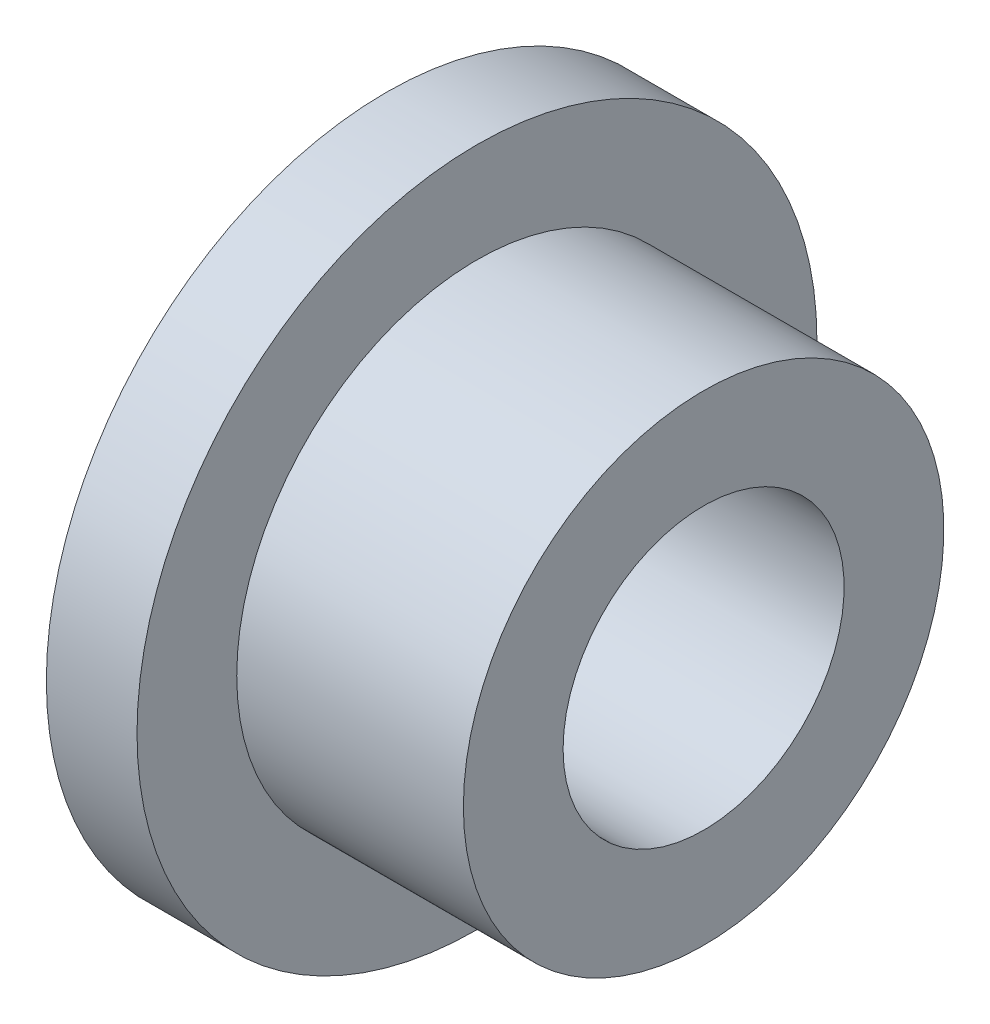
ISO-10303-21;
HEADER;
FILE_DESCRIPTION(('STEP AP214'),'2;1');
FILE_NAME('part.step','',(''),(''),'','','');
FILE_SCHEMA(('AUTOMOTIVE_DESIGN { 1 0 10303 214 1 1 1 1 }'));
ENDSEC;
DATA;
#1=APPLICATION_CONTEXT('core data for automotive mechanical design processes');
#2=APPLICATION_PROTOCOL_DEFINITION('international standard','automotive_design',2000,#1);
#3=PRODUCT_CONTEXT('',#1,'mechanical');
#4=PRODUCT('Part','Part','',(#3));
#5=PRODUCT_RELATED_PRODUCT_CATEGORY('part','',(#4));
#6=PRODUCT_DEFINITION_FORMATION('','',#4);
#7=PRODUCT_DEFINITION_CONTEXT('part definition',#1,'design');
#8=PRODUCT_DEFINITION('design','',#6,#7);
#9=PRODUCT_DEFINITION_SHAPE('','',#8);
#10=(LENGTH_UNIT() NAMED_UNIT(*) SI_UNIT(.MILLI.,.METRE.));
#11=(NAMED_UNIT(*) PLANE_ANGLE_UNIT() SI_UNIT($,.RADIAN.));
#12=(NAMED_UNIT(*) SI_UNIT($,.STERADIAN.) SOLID_ANGLE_UNIT());
#13=UNCERTAINTY_MEASURE_WITH_UNIT(LENGTH_MEASURE(1.E-05),#10,'distance_accuracy_value','');
#14=(GEOMETRIC_REPRESENTATION_CONTEXT(3) GLOBAL_UNCERTAINTY_ASSIGNED_CONTEXT((#13)) GLOBAL_UNIT_ASSIGNED_CONTEXT((#10,
#11,#12)) REPRESENTATION_CONTEXT('',''));
#15=CARTESIAN_POINT('',(0.,0.,0.));
#16=DIRECTION('',(0.,0.,1.));
#17=DIRECTION('',(1.,0.,0.));
#18=AXIS2_PLACEMENT_3D('',#15,#16,#17);
#19=CARTESIAN_POINT('',(-1.77635683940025E-12,0.,0.));
#20=DIRECTION('',(-1.,0.,0.));
#21=DIRECTION('',(0.,0.,1.00000000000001));
#22=AXIS2_PLACEMENT_3D('',#19,#20,#21);
#23=CYLINDRICAL_SURFACE('',#22,3.1);
#24=CARTESIAN_POINT('',(6.99999999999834,3.1641356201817E-12,1.11022302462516E-13));
#25=DIRECTION('',(-1.,0.,0.));
#26=DIRECTION('',(0.,0.,1.00000000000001));
#27=AXIS2_PLACEMENT_3D('',#24,#25,#26);
#28=CIRCLE('',#27,3.1);
#29=CARTESIAN_POINT('',(6.99999999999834,3.1641356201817E-12,3.10000000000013));
#30=VERTEX_POINT('',#29);
#31=EDGE_CURVE('E10',#30,#30,#28,.T.);
#32=ORIENTED_EDGE('',*,*,#31,.F.);
#33=EDGE_LOOP('',(#32));
#34=FACE_BOUND('',#33,.T.);
#35=CARTESIAN_POINT('',(-1.77635683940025E-12,0.,0.));
#36=DIRECTION('',(-1.,0.,0.));
#37=DIRECTION('',(0.,0.,1.00000000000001));
#38=AXIS2_PLACEMENT_3D('',#35,#36,#37);
#39=CIRCLE('',#38,3.1);
#40=CARTESIAN_POINT('',(-1.77635683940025E-12,0.,3.10000000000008));
#41=VERTEX_POINT('',#40);
#42=EDGE_CURVE('E64',#41,#41,#39,.T.);
#43=ORIENTED_EDGE('',*,*,#42,.T.);
#44=EDGE_LOOP('',(#43));
#45=FACE_BOUND('',#44,.T.);
#46=ADVANCED_FACE('F36',(#34,#45),#23,.F.);
#47=CARTESIAN_POINT('',(6.99999999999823,5.30000000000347,0.));
#48=DIRECTION('',(-1.,0.,0.));
#49=DIRECTION('',(0.,0.,1.00000000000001));
#50=AXIS2_PLACEMENT_3D('',#47,#48,#49);
#51=PLANE('',#50);
#52=CARTESIAN_POINT('',(6.99999999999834,3.1641356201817E-12,1.11022302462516E-13));
#53=DIRECTION('',(-1.,0.,0.));
#54=DIRECTION('',(0.,0.,1.00000000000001));
#55=AXIS2_PLACEMENT_3D('',#52,#53,#54);
#56=CIRCLE('',#55,5.3);
#57=CARTESIAN_POINT('',(6.99999999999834,3.1641356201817E-12,5.30000000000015));
#58=VERTEX_POINT('',#57);
#59=EDGE_CURVE('E43',#58,#58,#56,.T.);
#60=ORIENTED_EDGE('',*,*,#59,.F.);
#61=EDGE_LOOP('',(#60));
#62=FACE_BOUND('',#61,.T.);
#63=ORIENTED_EDGE('',*,*,#31,.T.);
#64=EDGE_LOOP('',(#63));
#65=FACE_BOUND('',#64,.T.);
#66=ADVANCED_FACE('F89',(#62,#65),#51,.F.);
#67=CARTESIAN_POINT('',(-1.77635683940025E-12,0.,0.));
#68=DIRECTION('',(-1.,0.,0.));
#69=DIRECTION('',(0.,0.,1.00000000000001));
#70=AXIS2_PLACEMENT_3D('',#67,#68,#69);
#71=CYLINDRICAL_SURFACE('',#70,5.3);
#72=CARTESIAN_POINT('',(1.99999999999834,2.22044604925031E-12,-6.66133814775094E-13));
#73=DIRECTION('',(-1.,0.,0.));
#74=DIRECTION('',(0.,0.,1.00000000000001));
#75=AXIS2_PLACEMENT_3D('',#72,#73,#74);
#76=CIRCLE('',#75,5.3);
#77=CARTESIAN_POINT('',(1.99999999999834,2.22044604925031E-12,5.29999999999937));
#78=VERTEX_POINT('',#77);
#79=EDGE_CURVE('E50',#78,#78,#76,.T.);
#80=ORIENTED_EDGE('',*,*,#79,.F.);
#81=EDGE_LOOP('',(#80));
#82=FACE_BOUND('',#81,.T.);
#83=ORIENTED_EDGE('',*,*,#59,.T.);
#84=EDGE_LOOP('',(#83));
#85=FACE_BOUND('',#84,.T.);
#86=ADVANCED_FACE('F84',(#82,#85),#71,.T.);
#87=CARTESIAN_POINT('',(1.99999999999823,7.50000000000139,-1.66533453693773E-13));
#88=DIRECTION('',(-1.,0.,0.));
#89=DIRECTION('',(0.,0.,1.00000000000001));
#90=AXIS2_PLACEMENT_3D('',#87,#88,#89);
#91=PLANE('',#90);
#92=CARTESIAN_POINT('',(1.99999999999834,2.22044604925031E-12,-6.66133814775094E-13));
#93=DIRECTION('',(-1.,0.,0.));
#94=DIRECTION('',(0.,0.,1.00000000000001));
#95=AXIS2_PLACEMENT_3D('',#92,#93,#94);
#96=CIRCLE('',#95,7.5);
#97=CARTESIAN_POINT('',(1.99999999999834,2.22044604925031E-12,7.49999999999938));
#98=VERTEX_POINT('',#97);
#99=EDGE_CURVE('E56',#98,#98,#96,.T.);
#100=ORIENTED_EDGE('',*,*,#99,.F.);
#101=EDGE_LOOP('',(#100));
#102=FACE_BOUND('',#101,.T.);
#103=ORIENTED_EDGE('',*,*,#79,.T.);
#104=EDGE_LOOP('',(#103));
#105=FACE_BOUND('',#104,.T.);
#106=ADVANCED_FACE('F78',(#102,#105),#91,.F.);
#107=CARTESIAN_POINT('',(-1.77635683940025E-12,0.,0.));
#108=DIRECTION('',(-1.,0.,0.));
#109=DIRECTION('',(0.,0.,1.00000000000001));
#110=AXIS2_PLACEMENT_3D('',#107,#108,#109);
#111=CYLINDRICAL_SURFACE('',#110,7.5);
#112=CARTESIAN_POINT('',(-1.77635683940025E-12,0.,0.));
#113=DIRECTION('',(-1.,0.,0.));
#114=DIRECTION('',(0.,0.,1.00000000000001));
#115=AXIS2_PLACEMENT_3D('',#112,#113,#114);
#116=CIRCLE('',#115,7.5);
#117=CARTESIAN_POINT('',(-1.77635683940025E-12,0.,7.50000000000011));
#118=VERTEX_POINT('',#117);
#119=EDGE_CURVE('E61',#118,#118,#116,.T.);
#120=ORIENTED_EDGE('',*,*,#119,.F.);
#121=EDGE_LOOP('',(#120));
#122=FACE_BOUND('',#121,.T.);
#123=ORIENTED_EDGE('',*,*,#99,.T.);
#124=EDGE_LOOP('',(#123));
#125=FACE_BOUND('',#124,.T.);
#126=ADVANCED_FACE('F72',(#122,#125),#111,.T.);
#127=CARTESIAN_POINT('',(-1.77635683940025E-12,3.10000000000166,1.11022302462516E-13));
#128=DIRECTION('',(1.,0.,0.));
#129=DIRECTION('',(0.,0.,-1.00000000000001));
#130=AXIS2_PLACEMENT_3D('',#127,#128,#129);
#131=PLANE('',#130);
#132=ORIENTED_EDGE('',*,*,#42,.F.);
#133=EDGE_LOOP('',(#132));
#134=FACE_BOUND('',#133,.T.);
#135=ORIENTED_EDGE('',*,*,#119,.T.);
#136=EDGE_LOOP('',(#135));
#137=FACE_BOUND('',#136,.T.);
#138=ADVANCED_FACE('F69',(#134,#137),#131,.F.);
#139=CLOSED_SHELL('',(#46,#66,#86,#106,#126,#138));
#140=MANIFOLD_SOLID_BREP('B2',#139);
#141=ADVANCED_BREP_SHAPE_REPRESENTATION('',(#18,#140),#14);
#142=SHAPE_DEFINITION_REPRESENTATION(#9,#141);
ENDSEC;
END-ISO-10303-21;
